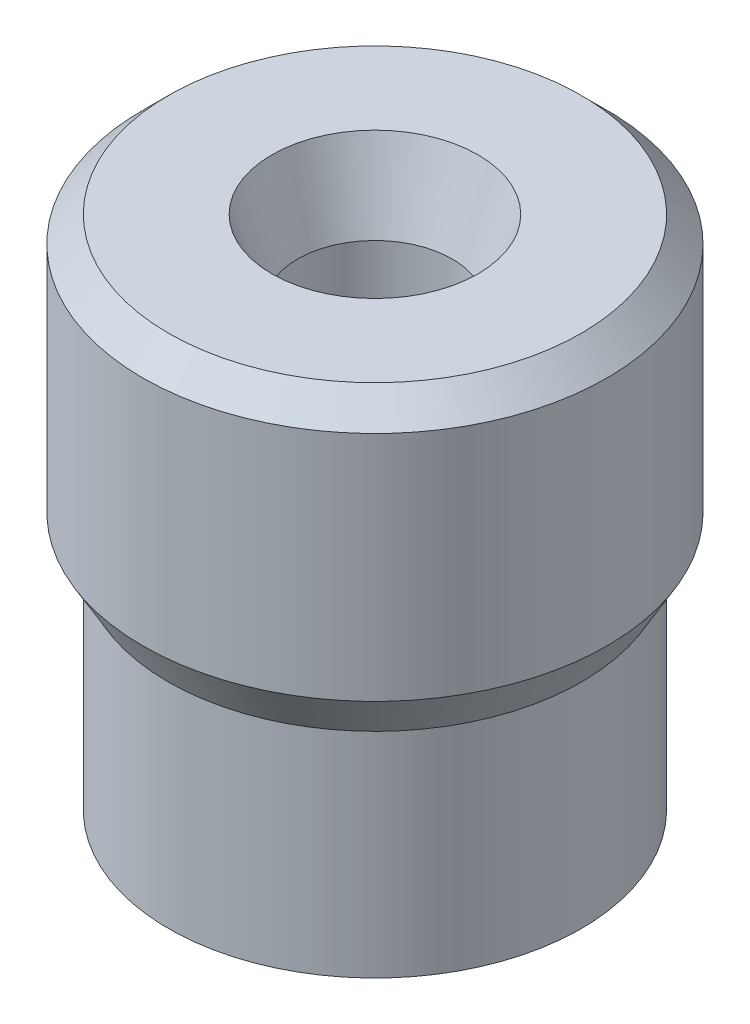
ISO-10303-21;
HEADER;
FILE_DESCRIPTION(('STEP AP214'),'2;1');
FILE_NAME('part.step','',(''),(''),'','','');
FILE_SCHEMA(('AUTOMOTIVE_DESIGN { 1 0 10303 214 1 1 1 1 }'));
ENDSEC;
DATA;
#1=APPLICATION_CONTEXT('core data for automotive mechanical design processes');
#2=APPLICATION_PROTOCOL_DEFINITION('international standard','automotive_design',2000,#1);
#3=PRODUCT_CONTEXT('',#1,'mechanical');
#4=PRODUCT('Part','Part','',(#3));
#5=PRODUCT_RELATED_PRODUCT_CATEGORY('part','',(#4));
#6=PRODUCT_DEFINITION_FORMATION('','',#4);
#7=PRODUCT_DEFINITION_CONTEXT('part definition',#1,'design');
#8=PRODUCT_DEFINITION('design','',#6,#7);
#9=PRODUCT_DEFINITION_SHAPE('','',#8);
#10=(LENGTH_UNIT() NAMED_UNIT(*) SI_UNIT(.MILLI.,.METRE.));
#11=(NAMED_UNIT(*) PLANE_ANGLE_UNIT() SI_UNIT($,.RADIAN.));
#12=(NAMED_UNIT(*) SI_UNIT($,.STERADIAN.) SOLID_ANGLE_UNIT());
#13=UNCERTAINTY_MEASURE_WITH_UNIT(LENGTH_MEASURE(1.E-05),#10,'distance_accuracy_value','');
#14=(GEOMETRIC_REPRESENTATION_CONTEXT(3) GLOBAL_UNCERTAINTY_ASSIGNED_CONTEXT((#13)) GLOBAL_UNIT_ASSIGNED_CONTEXT((#10,
#11,#12)) REPRESENTATION_CONTEXT('',''));
#15=CARTESIAN_POINT('',(0.,0.,0.));
#16=DIRECTION('',(0.,0.,1.));
#17=DIRECTION('',(1.,0.,0.));
#18=AXIS2_PLACEMENT_3D('',#15,#16,#17);
#19=CARTESIAN_POINT('',(0.,8.3,0.));
#20=DIRECTION('',(0.,-1.,0.));
#21=DIRECTION('',(0.,0.,-1.));
#22=AXIS2_PLACEMENT_3D('',#19,#20,#21);
#23=CYLINDRICAL_SURFACE('',#22,8.);
#24=CARTESIAN_POINT('',(0.,8.3,0.));
#25=DIRECTION('',(0.,1.,0.));
#26=DIRECTION('',(0.,0.,1.));
#27=AXIS2_PLACEMENT_3D('',#24,#25,#26);
#28=CIRCLE('',#27,8.);
#29=CARTESIAN_POINT('',(0.,8.3,-8.));
#30=VERTEX_POINT('',#29);
#31=EDGE_CURVE('E61',#30,#30,#28,.T.);
#32=CARTESIAN_POINT('',(0.,0.,0.));
#33=DIRECTION('',(0.,1.,0.));
#34=DIRECTION('',(0.,0.,1.));
#35=AXIS2_PLACEMENT_3D('',#32,#33,#34);
#36=CIRCLE('',#35,8.);
#37=CARTESIAN_POINT('',(0.,0.,-8.));
#38=VERTEX_POINT('',#37);
#39=EDGE_CURVE('E62',#38,#38,#36,.T.);
#40=CARTESIAN_POINT('',(0.,8.3,-8.));
#41=CARTESIAN_POINT('',(0.,8.21354166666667,-8.));
#42=CARTESIAN_POINT('',(0.,8.12708333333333,-8.));
#43=CARTESIAN_POINT('',(0.,7.95416666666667,-8.));
#44=CARTESIAN_POINT('',(0.,7.86770833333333,-8.));
#45=CARTESIAN_POINT('',(0.,7.69479166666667,-8.));
#46=CARTESIAN_POINT('',(0.,7.60833333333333,-8.));
#47=CARTESIAN_POINT('',(0.,7.43541666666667,-8.));
#48=CARTESIAN_POINT('',(0.,7.34895833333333,-8.));
#49=CARTESIAN_POINT('',(0.,7.17604166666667,-8.));
#50=CARTESIAN_POINT('',(0.,7.08958333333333,-8.));
#51=CARTESIAN_POINT('',(0.,6.91666666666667,-8.));
#52=CARTESIAN_POINT('',(0.,6.83020833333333,-8.));
#53=CARTESIAN_POINT('',(0.,6.65729166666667,-8.));
#54=CARTESIAN_POINT('',(0.,6.57083333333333,-8.));
#55=CARTESIAN_POINT('',(0.,6.39791666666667,-8.));
#56=CARTESIAN_POINT('',(0.,6.31145833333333,-8.));
#57=CARTESIAN_POINT('',(0.,6.13854166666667,-8.));
#58=CARTESIAN_POINT('',(0.,6.05208333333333,-8.));
#59=CARTESIAN_POINT('',(0.,5.87916666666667,-8.));
#60=CARTESIAN_POINT('',(0.,5.79270833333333,-8.));
#61=CARTESIAN_POINT('',(0.,5.61979166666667,-8.));
#62=CARTESIAN_POINT('',(0.,5.53333333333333,-8.));
#63=CARTESIAN_POINT('',(0.,5.36041666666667,-8.));
#64=CARTESIAN_POINT('',(0.,5.27395833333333,-8.));
#65=CARTESIAN_POINT('',(0.,5.10104166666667,-8.));
#66=CARTESIAN_POINT('',(0.,5.01458333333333,-8.));
#67=CARTESIAN_POINT('',(0.,4.84166666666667,-8.));
#68=CARTESIAN_POINT('',(0.,4.75520833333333,-8.));
#69=CARTESIAN_POINT('',(0.,4.58229166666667,-8.));
#70=CARTESIAN_POINT('',(0.,4.49583333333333,-8.));
#71=CARTESIAN_POINT('',(0.,4.32291666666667,-8.));
#72=CARTESIAN_POINT('',(0.,4.23645833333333,-8.));
#73=CARTESIAN_POINT('',(0.,4.06354166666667,-8.));
#74=CARTESIAN_POINT('',(0.,3.97708333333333,-8.));
#75=CARTESIAN_POINT('',(0.,3.80416666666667,-8.));
#76=CARTESIAN_POINT('',(0.,3.71770833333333,-8.));
#77=CARTESIAN_POINT('',(0.,3.54479166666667,-8.));
#78=CARTESIAN_POINT('',(0.,3.45833333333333,-8.));
#79=CARTESIAN_POINT('',(0.,3.28541666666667,-8.));
#80=CARTESIAN_POINT('',(0.,3.19895833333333,-8.));
#81=CARTESIAN_POINT('',(0.,3.02604166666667,-8.));
#82=CARTESIAN_POINT('',(0.,2.93958333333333,-8.));
#83=CARTESIAN_POINT('',(0.,2.76666666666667,-8.));
#84=CARTESIAN_POINT('',(0.,2.68020833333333,-8.));
#85=CARTESIAN_POINT('',(0.,2.50729166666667,-8.));
#86=CARTESIAN_POINT('',(0.,2.42083333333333,-8.));
#87=CARTESIAN_POINT('',(0.,2.24791666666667,-8.));
#88=CARTESIAN_POINT('',(0.,2.16145833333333,-8.));
#89=CARTESIAN_POINT('',(0.,1.98854166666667,-8.));
#90=CARTESIAN_POINT('',(0.,1.90208333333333,-8.));
#91=CARTESIAN_POINT('',(0.,1.72916666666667,-8.));
#92=CARTESIAN_POINT('',(0.,1.64270833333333,-8.));
#93=CARTESIAN_POINT('',(0.,1.46979166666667,-8.));
#94=CARTESIAN_POINT('',(0.,1.38333333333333,-8.));
#95=CARTESIAN_POINT('',(0.,1.21041666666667,-8.));
#96=CARTESIAN_POINT('',(0.,1.12395833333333,-8.));
#97=CARTESIAN_POINT('',(0.,0.951041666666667,-8.));
#98=CARTESIAN_POINT('',(0.,0.864583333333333,-8.));
#99=CARTESIAN_POINT('',(0.,0.691666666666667,-8.));
#100=CARTESIAN_POINT('',(0.,0.605208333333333,-8.));
#101=CARTESIAN_POINT('',(0.,0.432291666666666,-8.));
#102=CARTESIAN_POINT('',(0.,0.345833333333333,-8.));
#103=CARTESIAN_POINT('',(0.,0.172916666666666,-8.));
#104=CARTESIAN_POINT('',(0.,0.086458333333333,-8.));
#105=CARTESIAN_POINT('',(0.,0.,-8.));
#106=B_SPLINE_CURVE_WITH_KNOTS('',3,(#40,#41,#42,#43,#44,#45,#46,#47,#48,#49,#50,#51,#52,#53,
#54,#55,#56,#57,#58,#59,#60,#61,#62,#63,#64,#65,#66,#67,#68,#69,#70,#71,#72,#73,#74,#75,#76,#77,
#78,#79,#80,#81,#82,#83,#84,#85,#86,#87,#88,#89,#90,#91,#92,#93,#94,#95,#96,#97,#98,#99,#100,
#101,#102,#103,#104,#105),.UNSPECIFIED.,.F.,.F.,(4,2,2,2,2,2,2,2,2,2,2,2,2,2,2,2,2,2,2,2,2,2,2,
2,2,2,2,2,2,2,2,2,4),(0.,0.259374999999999,0.518749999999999,0.778124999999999,1.0375,1.296875,
1.55625,1.815625,2.075,2.334375,2.59375,2.853125,3.1125,3.371875,3.63125,3.890625,4.15,4.409375,
4.66875,4.928125,5.1875,5.446875,5.70625,5.965625,6.225,6.484375,6.74375,7.003125,7.2625,
7.521875,7.78125,8.040625,8.3),.UNSPECIFIED.);
#107=EDGE_CURVE('BSEAM35',#30,#38,#106,.T.);
#108=ORIENTED_EDGE('',*,*,#31,.F.);
#109=ORIENTED_EDGE('',*,*,#39,.T.);
#110=ORIENTED_EDGE('',*,*,#107,.T.);
#111=ORIENTED_EDGE('',*,*,#107,.F.);
#112=EDGE_LOOP('',(#108,#110,#109,#111));
#113=FACE_BOUND('',#112,.T.);
#114=ADVANCED_FACE('F35',(#113),#23,.T.);
#115=CARTESIAN_POINT('',(0.,0.,0.));
#116=DIRECTION('',(0.,1.,0.));
#117=DIRECTION('',(0.,0.,1.));
#118=AXIS2_PLACEMENT_3D('',#115,#116,#117);
#119=PLANE('',#118);
#120=CARTESIAN_POINT('',(0.,0.,0.));
#121=DIRECTION('',(0.,-1.,0.));
#122=DIRECTION('',(0.,0.,-1.));
#123=AXIS2_PLACEMENT_3D('',#120,#121,#122);
#124=CIRCLE('',#123,2.);
#125=CARTESIAN_POINT('',(0.,0.,-2.));
#126=VERTEX_POINT('',#125);
#127=EDGE_CURVE('E65',#126,#126,#124,.T.);
#128=ORIENTED_EDGE('',*,*,#127,.F.);
#129=EDGE_LOOP('',(#128));
#130=FACE_BOUND('',#129,.T.);
#131=ORIENTED_EDGE('',*,*,#39,.F.);
#132=EDGE_LOOP('',(#131));
#133=FACE_BOUND('',#132,.T.);
#134=ADVANCED_FACE('F92',(#130,#133),#119,.F.);
#135=CARTESIAN_POINT('',(0.,8.3,0.));
#136=DIRECTION('',(0.,1.,0.));
#137=DIRECTION('',(0.,0.,1.));
#138=AXIS2_PLACEMENT_3D('',#135,#136,#137);
#139=PLANE('',#138);
#140=CARTESIAN_POINT('',(0.,8.3,0.));
#141=DIRECTION('',(0.,1.,0.));
#142=DIRECTION('',(0.,0.,1.));
#143=AXIS2_PLACEMENT_3D('',#140,#141,#142);
#144=CIRCLE('',#143,8.01850454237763);
#145=CARTESIAN_POINT('',(0.,8.3,8.01850454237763));
#146=VERTEX_POINT('',#145);
#147=EDGE_CURVE('E55',#146,#146,#144,.F.);
#148=ORIENTED_EDGE('',*,*,#147,.T.);
#149=EDGE_LOOP('',(#148));
#150=FACE_BOUND('',#149,.T.);
#151=ORIENTED_EDGE('',*,*,#31,.T.);
#152=EDGE_LOOP('',(#151));
#153=FACE_BOUND('',#152,.T.);
#154=ADVANCED_FACE('F98',(#150,#153),#139,.F.);
#155=CARTESIAN_POINT('',(0.,20.,0.));
#156=DIRECTION('',(0.,-1.,0.));
#157=DIRECTION('',(0.,0.,-1.));
#158=AXIS2_PLACEMENT_3D('',#155,#156,#157);
#159=CYLINDRICAL_SURFACE('',#158,9.);
#160=CARTESIAN_POINT('',(0.,19.,0.));
#161=DIRECTION('',(0.,1.,0.));
#162=DIRECTION('',(0.,0.,1.));
#163=AXIS2_PLACEMENT_3D('',#160,#161,#162);
#164=CIRCLE('',#163,9.);
#165=CARTESIAN_POINT('',(0.,19.,9.));
#166=VERTEX_POINT('',#165);
#167=EDGE_CURVE('E46',#166,#166,#164,.F.);
#168=ORIENTED_EDGE('',*,*,#167,.T.);
#169=EDGE_LOOP('',(#168));
#170=FACE_BOUND('',#169,.T.);
#171=CARTESIAN_POINT('',(0.,10.,0.));
#172=DIRECTION('',(0.,1.,0.));
#173=DIRECTION('',(0.,0.,1.));
#174=AXIS2_PLACEMENT_3D('',#171,#172,#173);
#175=CIRCLE('',#174,9.);
#176=CARTESIAN_POINT('',(0.,10.,9.));
#177=VERTEX_POINT('',#176);
#178=EDGE_CURVE('E58',#177,#177,#175,.T.);
#179=ORIENTED_EDGE('',*,*,#178,.T.);
#180=EDGE_LOOP('',(#179));
#181=FACE_BOUND('',#180,.T.);
#182=ADVANCED_FACE('F121',(#170,#181),#159,.T.);
#183=CARTESIAN_POINT('',(0.,20.,0.));
#184=DIRECTION('',(0.,1.,0.));
#185=DIRECTION('',(0.,0.,1.));
#186=AXIS2_PLACEMENT_3D('',#183,#184,#185);
#187=PLANE('',#186);
#188=CARTESIAN_POINT('',(0.,20.,0.));
#189=DIRECTION('',(0.,1.,0.));
#190=DIRECTION('',(0.,0.,1.));
#191=AXIS2_PLACEMENT_3D('',#188,#189,#190);
#192=CIRCLE('',#191,4.00000000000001);
#193=CARTESIAN_POINT('',(0.,20.,4.00000000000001));
#194=VERTEX_POINT('',#193);
#195=EDGE_CURVE('E10',#194,#194,#192,.F.);
#196=ORIENTED_EDGE('',*,*,#195,.T.);
#197=EDGE_LOOP('',(#196));
#198=FACE_BOUND('',#197,.T.);
#199=CARTESIAN_POINT('',(0.,20.,0.));
#200=DIRECTION('',(0.,1.,0.));
#201=DIRECTION('',(0.,0.,1.));
#202=AXIS2_PLACEMENT_3D('',#199,#200,#201);
#203=CIRCLE('',#202,8.);
#204=CARTESIAN_POINT('',(0.,20.,8.));
#205=VERTEX_POINT('',#204);
#206=EDGE_CURVE('E50',#205,#205,#203,.T.);
#207=ORIENTED_EDGE('',*,*,#206,.T.);
#208=EDGE_LOOP('',(#207));
#209=FACE_BOUND('',#208,.T.);
#210=ADVANCED_FACE('F108',(#198,#209),#187,.T.);
#211=CARTESIAN_POINT('',(0.,10.,0.));
#212=DIRECTION('',(0.,1.,0.));
#213=DIRECTION('',(0.,0.,1.));
#214=AXIS2_PLACEMENT_3D('',#211,#212,#213);
#215=CONICAL_SURFACE('',#214,9.,0.523598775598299);
#216=ORIENTED_EDGE('',*,*,#147,.F.);
#217=EDGE_LOOP('',(#216));
#218=FACE_BOUND('',#217,.T.);
#219=ORIENTED_EDGE('',*,*,#178,.F.);
#220=EDGE_LOOP('',(#219));
#221=FACE_BOUND('',#220,.T.);
#222=ADVANCED_FACE('F105',(#218,#221),#215,.T.);
#223=CARTESIAN_POINT('',(0.,20.,0.));
#224=DIRECTION('',(0.,-1.,0.));
#225=DIRECTION('',(0.,0.,-1.));
#226=AXIS2_PLACEMENT_3D('',#223,#224,#225);
#227=CONICAL_SURFACE('',#226,8.,0.785398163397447);
#228=ORIENTED_EDGE('',*,*,#167,.F.);
#229=EDGE_LOOP('',(#228));
#230=FACE_BOUND('',#229,.T.);
#231=ORIENTED_EDGE('',*,*,#206,.F.);
#232=EDGE_LOOP('',(#231));
#233=FACE_BOUND('',#232,.T.);
#234=ADVANCED_FACE('F107',(#230,#233),#227,.T.);
#235=CARTESIAN_POINT('',(0.,11.,0.));
#236=DIRECTION('',(0.,-1.,0.));
#237=DIRECTION('',(0.,0.,-1.));
#238=AXIS2_PLACEMENT_3D('',#235,#236,#237);
#239=CYLINDRICAL_SURFACE('',#238,2.);
#240=CARTESIAN_POINT('',(0.,11.,0.));
#241=DIRECTION('',(0.,1.,0.));
#242=DIRECTION('',(0.,0.,1.));
#243=AXIS2_PLACEMENT_3D('',#240,#241,#242);
#244=CIRCLE('',#243,2.);
#245=CARTESIAN_POINT('',(0.,11.,2.));
#246=VERTEX_POINT('',#245);
#247=EDGE_CURVE('E70',#246,#246,#244,.F.);
#248=ORIENTED_EDGE('',*,*,#247,.F.);
#249=EDGE_LOOP('',(#248));
#250=FACE_BOUND('',#249,.T.);
#251=ORIENTED_EDGE('',*,*,#127,.T.);
#252=EDGE_LOOP('',(#251));
#253=FACE_BOUND('',#252,.T.);
#254=ADVANCED_FACE('F88',(#250,#253),#239,.F.);
#255=CARTESIAN_POINT('',(0.,11.,0.));
#256=DIRECTION('',(0.,1.,0.));
#257=DIRECTION('',(0.,0.,1.));
#258=AXIS2_PLACEMENT_3D('',#255,#256,#257);
#259=PLANE('',#258);
#260=CARTESIAN_POINT('',(0.,11.,0.));
#261=DIRECTION('',(0.,1.,0.));
#262=DIRECTION('',(0.,0.,1.));
#263=AXIS2_PLACEMENT_3D('',#260,#261,#262);
#264=CIRCLE('',#263,3.);
#265=CARTESIAN_POINT('',(0.,11.,3.));
#266=VERTEX_POINT('',#265);
#267=EDGE_CURVE('E73',#266,#266,#264,.T.);
#268=ORIENTED_EDGE('',*,*,#267,.T.);
#269=EDGE_LOOP('',(#268));
#270=FACE_BOUND('',#269,.T.);
#271=ORIENTED_EDGE('',*,*,#247,.T.);
#272=EDGE_LOOP('',(#271));
#273=FACE_BOUND('',#272,.T.);
#274=ADVANCED_FACE('F77',(#270,#273),#259,.T.);
#275=CARTESIAN_POINT('',(0.,11.,0.));
#276=DIRECTION('',(0.,1.,0.));
#277=DIRECTION('',(0.,0.,1.));
#278=AXIS2_PLACEMENT_3D('',#275,#276,#277);
#279=CYLINDRICAL_SURFACE('',#278,3.);
#280=CARTESIAN_POINT('',(0.,17.,0.));
#281=DIRECTION('',(0.,1.,0.));
#282=DIRECTION('',(0.,0.,1.));
#283=AXIS2_PLACEMENT_3D('',#280,#281,#282);
#284=CIRCLE('',#283,3.);
#285=CARTESIAN_POINT('',(0.,17.,3.));
#286=VERTEX_POINT('',#285);
#287=EDGE_CURVE('E42',#286,#286,#284,.T.);
#288=ORIENTED_EDGE('',*,*,#287,.T.);
#289=EDGE_LOOP('',(#288));
#290=FACE_BOUND('',#289,.T.);
#291=ORIENTED_EDGE('',*,*,#267,.F.);
#292=EDGE_LOOP('',(#291));
#293=FACE_BOUND('',#292,.T.);
#294=ADVANCED_FACE('F80',(#290,#293),#279,.F.);
#295=CARTESIAN_POINT('',(0.,17.,0.));
#296=DIRECTION('',(0.,1.,0.));
#297=DIRECTION('',(0.,0.,1.));
#298=AXIS2_PLACEMENT_3D('',#295,#296,#297);
#299=CONICAL_SURFACE('',#298,3.,0.321750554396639);
#300=ORIENTED_EDGE('',*,*,#195,.F.);
#301=EDGE_LOOP('',(#300));
#302=FACE_BOUND('',#301,.T.);
#303=ORIENTED_EDGE('',*,*,#287,.F.);
#304=EDGE_LOOP('',(#303));
#305=FACE_BOUND('',#304,.T.);
#306=ADVANCED_FACE('F37',(#302,#305),#299,.F.);
#307=CLOSED_SHELL('',(#114,#134,#154,#182,#210,#222,#234,#254,#274,#294,#306));
#308=MANIFOLD_SOLID_BREP('B2',#307);
#309=ADVANCED_BREP_SHAPE_REPRESENTATION('',(#18,#308),#14);
#310=SHAPE_DEFINITION_REPRESENTATION(#9,#309);
ENDSEC;
END-ISO-10303-21;
